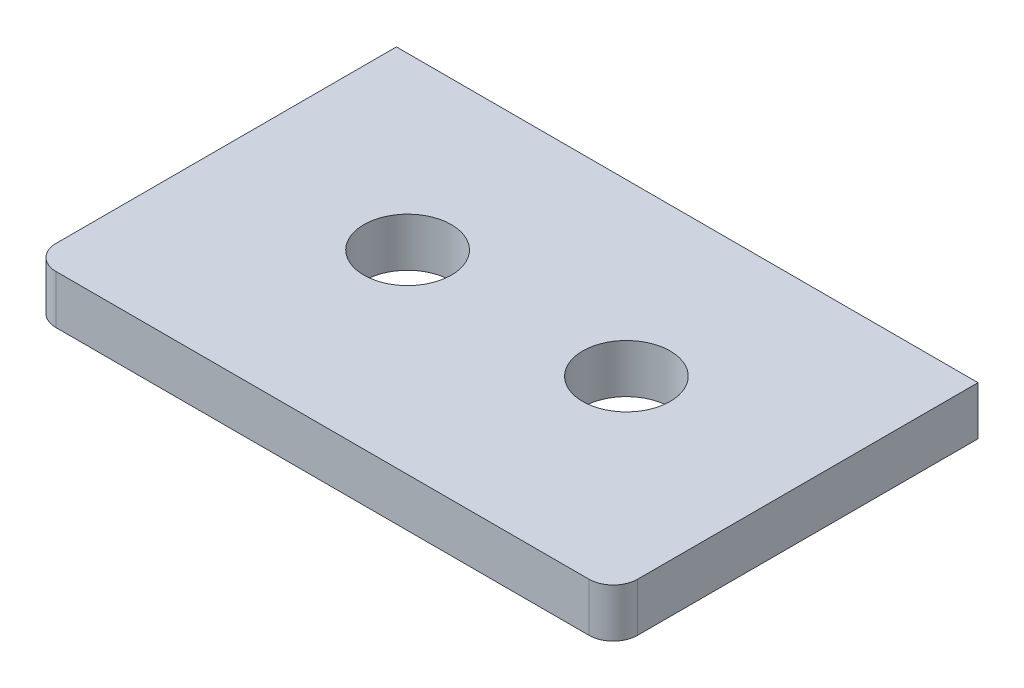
from build123d import *

# Parameters (mm, degrees)
ESQUISSE1_R        = 4.5
BOSS_EXTRU_1_DEPTH = 5


with BuildPart() as part:
    # Esquisse1 → Boss.-Extru.1 (new body)
    with BuildSketch(Plane(origin=(0, 2.5, 0), x_dir=(1, 0, 0), z_dir=(0, 1, 0))):
        with BuildLine():
            Line((29.9, 0), (-29.9, 0))
            Line((-29.9, 0), (-29.9, -35))
            ThreePointArc((-29.9, -35), (-29.167766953, -36.767766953), (-27.4, -37.5))
            Line((-27.4, -37.5), (27.4, -37.5))
            ThreePointArc((27.4, -37.5), (29.167766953, -36.767766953), (29.9, -35))
            Line((29.9, -35), (29.9, 0))
        make_face()
        with Locations(Location((11.25, -17.5, 0), (0, 0, 90))):
            Circle(ESQUISSE1_R, mode=Mode.SUBTRACT)
        with Locations(Location((-11.25, -17.5, 0), (0, 0, 90))):
            Circle(ESQUISSE1_R, mode=Mode.SUBTRACT)
    extrude(amount=-BOSS_EXTRU_1_DEPTH)


solid = part.part
